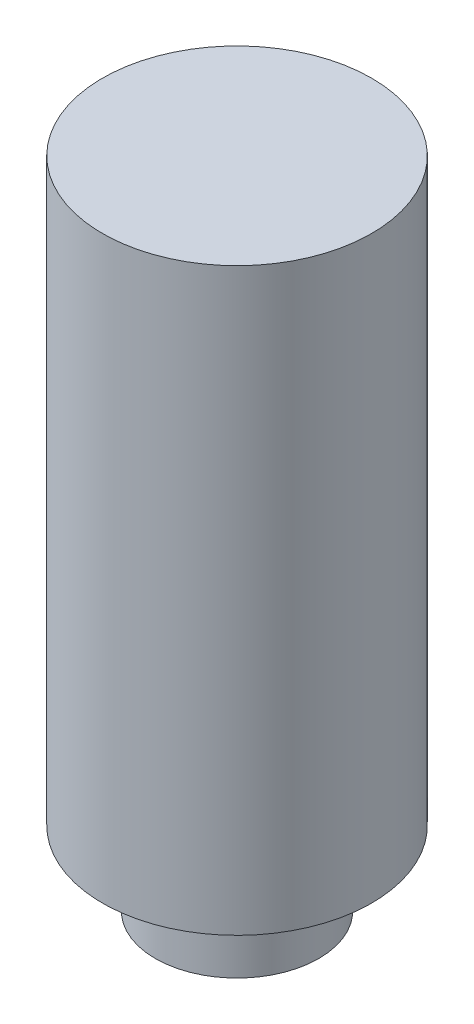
ISO-10303-21;
HEADER;
FILE_DESCRIPTION(('STEP AP214'),'2;1');
FILE_NAME('part.step','',(''),(''),'','','');
FILE_SCHEMA(('AUTOMOTIVE_DESIGN { 1 0 10303 214 1 1 1 1 }'));
ENDSEC;
DATA;
#1=APPLICATION_CONTEXT('core data for automotive mechanical design processes');
#2=APPLICATION_PROTOCOL_DEFINITION('international standard','automotive_design',2000,#1);
#3=PRODUCT_CONTEXT('',#1,'mechanical');
#4=PRODUCT('Part','Part','',(#3));
#5=PRODUCT_RELATED_PRODUCT_CATEGORY('part','',(#4));
#6=PRODUCT_DEFINITION_FORMATION('','',#4);
#7=PRODUCT_DEFINITION_CONTEXT('part definition',#1,'design');
#8=PRODUCT_DEFINITION('design','',#6,#7);
#9=PRODUCT_DEFINITION_SHAPE('','',#8);
#10=(LENGTH_UNIT() NAMED_UNIT(*) SI_UNIT(.MILLI.,.METRE.));
#11=(NAMED_UNIT(*) PLANE_ANGLE_UNIT() SI_UNIT($,.RADIAN.));
#12=(NAMED_UNIT(*) SI_UNIT($,.STERADIAN.) SOLID_ANGLE_UNIT());
#13=UNCERTAINTY_MEASURE_WITH_UNIT(LENGTH_MEASURE(1.E-05),#10,'distance_accuracy_value','');
#14=(GEOMETRIC_REPRESENTATION_CONTEXT(3) GLOBAL_UNCERTAINTY_ASSIGNED_CONTEXT((#13)) GLOBAL_UNIT_ASSIGNED_CONTEXT((#10,
#11,#12)) REPRESENTATION_CONTEXT('',''));
#15=CARTESIAN_POINT('',(0.,0.,0.));
#16=DIRECTION('',(0.,0.,1.));
#17=DIRECTION('',(1.,0.,0.));
#18=AXIS2_PLACEMENT_3D('',#15,#16,#17);
#19=CARTESIAN_POINT('',(0.,0.,0.));
#20=DIRECTION('',(0.,-1.,0.));
#21=DIRECTION('',(0.,0.,-1.));
#22=AXIS2_PLACEMENT_3D('',#19,#20,#21);
#23=PLANE('',#22);
#24=CARTESIAN_POINT('',(0.,0.,0.));
#25=DIRECTION('',(0.,-1.,0.));
#26=DIRECTION('',(0.,0.,-1.));
#27=AXIS2_PLACEMENT_3D('',#24,#25,#26);
#28=CIRCLE('',#27,1.397);
#29=CARTESIAN_POINT('',(0.,0.,-1.397));
#30=VERTEX_POINT('',#29);
#31=EDGE_CURVE('E10',#30,#30,#28,.T.);
#32=ORIENTED_EDGE('',*,*,#31,.T.);
#33=EDGE_LOOP('',(#32));
#34=FACE_BOUND('',#33,.T.);
#35=ADVANCED_FACE('F33',(#34),#23,.T.);
#36=CARTESIAN_POINT('',(0.,0.,0.));
#37=DIRECTION('',(0.,-1.,0.));
#38=DIRECTION('',(0.,0.,-1.));
#39=AXIS2_PLACEMENT_3D('',#36,#37,#38);
#40=CYLINDRICAL_SURFACE('',#39,1.397);
#41=CARTESIAN_POINT('',(0.,0.762,0.));
#42=DIRECTION('',(0.,-1.,0.));
#43=DIRECTION('',(0.,0.,-1.));
#44=AXIS2_PLACEMENT_3D('',#41,#42,#43);
#45=CIRCLE('',#44,1.397);
#46=CARTESIAN_POINT('',(0.,0.762,-1.397));
#47=VERTEX_POINT('',#46);
#48=EDGE_CURVE('E39',#47,#47,#45,.T.);
#49=ORIENTED_EDGE('',*,*,#48,.T.);
#50=EDGE_LOOP('',(#49));
#51=FACE_BOUND('',#50,.T.);
#52=ORIENTED_EDGE('',*,*,#31,.F.);
#53=EDGE_LOOP('',(#52));
#54=FACE_BOUND('',#53,.T.);
#55=ADVANCED_FACE('F71',(#51,#54),#40,.T.);
#56=CARTESIAN_POINT('',(0.,0.762,-1.397));
#57=DIRECTION('',(0.,1.,0.));
#58=DIRECTION('',(0.,0.,1.));
#59=AXIS2_PLACEMENT_3D('',#56,#57,#58);
#60=PLANE('',#59);
#61=CARTESIAN_POINT('',(0.,0.762,0.));
#62=DIRECTION('',(0.,-1.,0.));
#63=DIRECTION('',(0.,0.,-1.));
#64=AXIS2_PLACEMENT_3D('',#61,#62,#63);
#65=CIRCLE('',#64,1.27);
#66=CARTESIAN_POINT('',(0.,0.762,-1.27));
#67=VERTEX_POINT('',#66);
#68=EDGE_CURVE('E43',#67,#67,#65,.T.);
#69=ORIENTED_EDGE('',*,*,#68,.T.);
#70=EDGE_LOOP('',(#69));
#71=FACE_BOUND('',#70,.T.);
#72=ORIENTED_EDGE('',*,*,#48,.F.);
#73=EDGE_LOOP('',(#72));
#74=FACE_BOUND('',#73,.T.);
#75=ADVANCED_FACE('F75',(#71,#74),#60,.T.);
#76=CARTESIAN_POINT('',(0.,0.,0.));
#77=DIRECTION('',(0.,-1.,0.));
#78=DIRECTION('',(0.,0.,-1.));
#79=AXIS2_PLACEMENT_3D('',#76,#77,#78);
#80=CYLINDRICAL_SURFACE('',#79,1.27);
#81=CARTESIAN_POINT('',(0.,1.27,0.));
#82=DIRECTION('',(0.,-1.,0.));
#83=DIRECTION('',(0.,0.,-1.));
#84=AXIS2_PLACEMENT_3D('',#81,#82,#83);
#85=CIRCLE('',#84,1.27);
#86=CARTESIAN_POINT('',(0.,1.27,-1.27));
#87=VERTEX_POINT('',#86);
#88=EDGE_CURVE('E47',#87,#87,#85,.T.);
#89=ORIENTED_EDGE('',*,*,#88,.T.);
#90=EDGE_LOOP('',(#89));
#91=FACE_BOUND('',#90,.T.);
#92=ORIENTED_EDGE('',*,*,#68,.F.);
#93=EDGE_LOOP('',(#92));
#94=FACE_BOUND('',#93,.T.);
#95=ADVANCED_FACE('F79',(#91,#94),#80,.T.);
#96=CARTESIAN_POINT('',(0.,1.27,-2.2987));
#97=DIRECTION('',(0.,-1.,0.));
#98=DIRECTION('',(0.,0.,-1.));
#99=AXIS2_PLACEMENT_3D('',#96,#97,#98);
#100=PLANE('',#99);
#101=CARTESIAN_POINT('',(0.,1.27,0.));
#102=DIRECTION('',(0.,-1.,0.));
#103=DIRECTION('',(0.,0.,-1.));
#104=AXIS2_PLACEMENT_3D('',#101,#102,#103);
#105=CIRCLE('',#104,2.2987);
#106=CARTESIAN_POINT('',(0.,1.27,-2.2987));
#107=VERTEX_POINT('',#106);
#108=EDGE_CURVE('E52',#107,#107,#105,.T.);
#109=ORIENTED_EDGE('',*,*,#108,.T.);
#110=EDGE_LOOP('',(#109));
#111=FACE_BOUND('',#110,.T.);
#112=ORIENTED_EDGE('',*,*,#88,.F.);
#113=EDGE_LOOP('',(#112));
#114=FACE_BOUND('',#113,.T.);
#115=ADVANCED_FACE('F68',(#111,#114),#100,.T.);
#116=CARTESIAN_POINT('',(0.,0.,0.));
#117=DIRECTION('',(0.,-1.,0.));
#118=DIRECTION('',(0.,0.,-1.));
#119=AXIS2_PLACEMENT_3D('',#116,#117,#118);
#120=CYLINDRICAL_SURFACE('',#119,2.2987);
#121=CARTESIAN_POINT('',(0.,11.176,0.));
#122=DIRECTION('',(0.,-1.,0.));
#123=DIRECTION('',(0.,0.,-1.));
#124=AXIS2_PLACEMENT_3D('',#121,#122,#123);
#125=CIRCLE('',#124,2.2987);
#126=CARTESIAN_POINT('',(0.,11.176,-2.2987));
#127=VERTEX_POINT('',#126);
#128=EDGE_CURVE('E55',#127,#127,#125,.T.);
#129=ORIENTED_EDGE('',*,*,#128,.T.);
#130=EDGE_LOOP('',(#129));
#131=FACE_BOUND('',#130,.T.);
#132=ORIENTED_EDGE('',*,*,#108,.F.);
#133=EDGE_LOOP('',(#132));
#134=FACE_BOUND('',#133,.T.);
#135=ADVANCED_FACE('F59',(#131,#134),#120,.T.);
#136=CARTESIAN_POINT('',(0.,11.176,-2.2987));
#137=DIRECTION('',(0.,1.,0.));
#138=DIRECTION('',(0.,0.,1.));
#139=AXIS2_PLACEMENT_3D('',#136,#137,#138);
#140=PLANE('',#139);
#141=ORIENTED_EDGE('',*,*,#128,.F.);
#142=EDGE_LOOP('',(#141));
#143=FACE_BOUND('',#142,.T.);
#144=ADVANCED_FACE('F62',(#143),#140,.T.);
#145=CLOSED_SHELL('',(#35,#55,#75,#95,#115,#135,#144));
#146=MANIFOLD_SOLID_BREP('B2',#145);
#147=ADVANCED_BREP_SHAPE_REPRESENTATION('',(#18,#146),#14);
#148=SHAPE_DEFINITION_REPRESENTATION(#9,#147);
ENDSEC;
END-ISO-10303-21;
